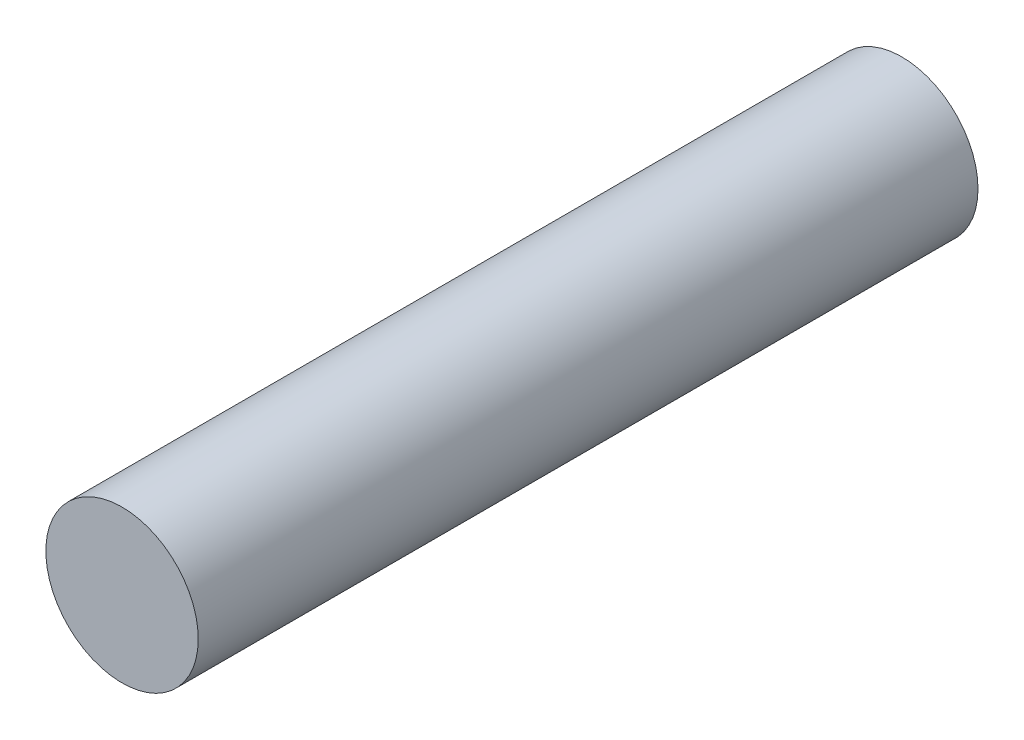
from build123d import *

# Parameters (mm, degrees)
SKETCH1_R           = 3
BOSS_EXTRUDE1_DEPTH = 30.7


with BuildPart() as part:
    # Sketch1 → Boss-Extrude1 (new body)
    with BuildSketch(Plane.XY):
        Circle(SKETCH1_R)
    extrude(amount=BOSS_EXTRUDE1_DEPTH)


solid = part.part
